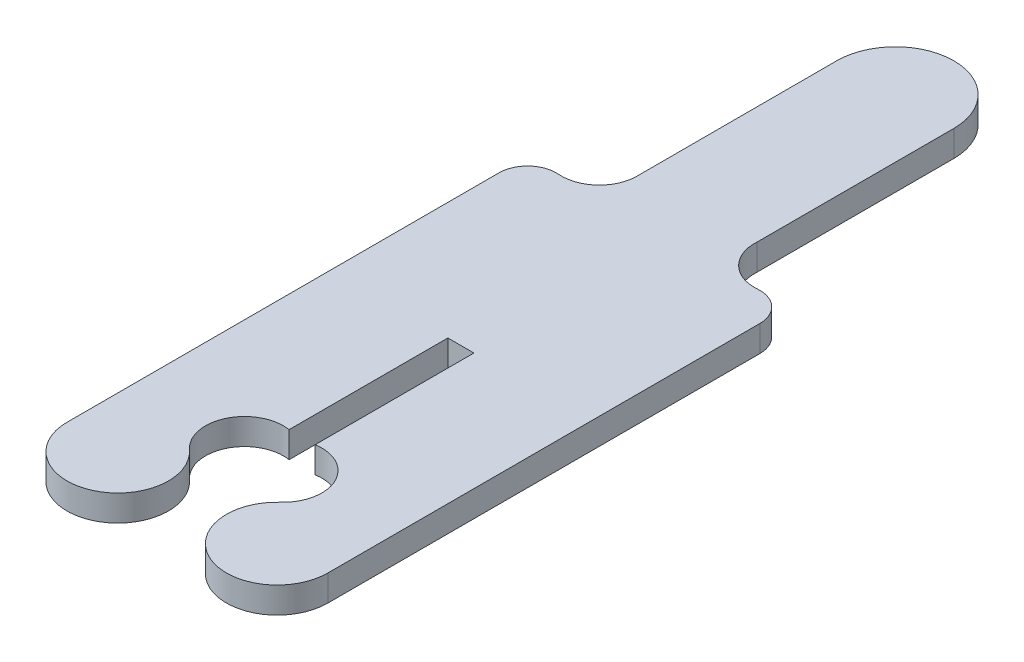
ISO-10303-21;
HEADER;
FILE_DESCRIPTION(('STEP AP214'),'2;1');
FILE_NAME('part.step','',(''),(''),'','','');
FILE_SCHEMA(('AUTOMOTIVE_DESIGN { 1 0 10303 214 1 1 1 1 }'));
ENDSEC;
DATA;
#1=APPLICATION_CONTEXT('core data for automotive mechanical design processes');
#2=APPLICATION_PROTOCOL_DEFINITION('international standard','automotive_design',2000,#1);
#3=PRODUCT_CONTEXT('',#1,'mechanical');
#4=PRODUCT('Part','Part','',(#3));
#5=PRODUCT_RELATED_PRODUCT_CATEGORY('part','',(#4));
#6=PRODUCT_DEFINITION_FORMATION('','',#4);
#7=PRODUCT_DEFINITION_CONTEXT('part definition',#1,'design');
#8=PRODUCT_DEFINITION('design','',#6,#7);
#9=PRODUCT_DEFINITION_SHAPE('','',#8);
#10=(LENGTH_UNIT() NAMED_UNIT(*) SI_UNIT(.MILLI.,.METRE.));
#11=(NAMED_UNIT(*) PLANE_ANGLE_UNIT() SI_UNIT($,.RADIAN.));
#12=(NAMED_UNIT(*) SI_UNIT($,.STERADIAN.) SOLID_ANGLE_UNIT());
#13=UNCERTAINTY_MEASURE_WITH_UNIT(LENGTH_MEASURE(1.E-05),#10,'distance_accuracy_value','');
#14=(GEOMETRIC_REPRESENTATION_CONTEXT(3) GLOBAL_UNCERTAINTY_ASSIGNED_CONTEXT((#13)) GLOBAL_UNIT_ASSIGNED_CONTEXT((#10,
#11,#12)) REPRESENTATION_CONTEXT('',''));
#15=CARTESIAN_POINT('',(0.,0.,0.));
#16=DIRECTION('',(0.,0.,1.));
#17=DIRECTION('',(1.,0.,0.));
#18=AXIS2_PLACEMENT_3D('',#15,#16,#17);
#19=CARTESIAN_POINT('',(-41777.0225889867,3.,-18289.7814477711));
#20=DIRECTION('',(0.,-1.,0.));
#21=DIRECTION('',(0.,0.,-1.));
#22=AXIS2_PLACEMENT_3D('',#19,#20,#21);
#23=CYLINDRICAL_SURFACE('',#22,4.47729575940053);
#24=CARTESIAN_POINT('',(-41777.0225889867,0.,-18289.7814477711));
#25=DIRECTION('',(0.,-1.,0.));
#26=DIRECTION('',(0.,0.,1.));
#27=AXIS2_PLACEMENT_3D('',#24,#25,#26);
#28=CIRCLE('',#27,4.47729575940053);
#29=CARTESIAN_POINT('',(-41777.738281,0.,-18294.201172));
#30=VERTEX_POINT('',#29);
#31=CARTESIAN_POINT('',(-41774.003968,0.,-18286.474772));
#32=VERTEX_POINT('',#31);
#33=EDGE_CURVE('E180',#30,#32,#28,.T.);
#34=ORIENTED_EDGE('',*,*,#33,.T.);
#35=DIRECTION('',(0.,-1.,0.));
#36=VECTOR('',#35,1.);
#37=CARTESIAN_POINT('',(-41774.003968,3.,-18286.474772));
#38=LINE('',#37,#36);
#39=CARTESIAN_POINT('',(-41774.003968,3.,-18286.474772));
#40=VERTEX_POINT('',#39);
#41=EDGE_CURVE('E11',#40,#32,#38,.T.);
#42=ORIENTED_EDGE('',*,*,#41,.F.);
#43=CARTESIAN_POINT('',(-41777.0225889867,3.,-18289.7814477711));
#44=DIRECTION('',(0.,-1.,0.));
#45=DIRECTION('',(0.,0.,1.));
#46=AXIS2_PLACEMENT_3D('',#43,#44,#45);
#47=CIRCLE('',#46,4.47729575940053);
#48=CARTESIAN_POINT('',(-41777.738281,3.,-18294.201172));
#49=VERTEX_POINT('',#48);
#50=EDGE_CURVE('E210',#49,#40,#47,.T.);
#51=ORIENTED_EDGE('',*,*,#50,.F.);
#52=DIRECTION('',(0.,-1.,0.));
#53=VECTOR('',#52,1.);
#54=CARTESIAN_POINT('',(-41777.738281,3.,-18294.201172));
#55=LINE('',#54,#53);
#56=EDGE_CURVE('E176',#49,#30,#55,.T.);
#57=ORIENTED_EDGE('',*,*,#56,.T.);
#58=EDGE_LOOP('',(#34,#42,#51,#57));
#59=FACE_BOUND('',#58,.T.);
#60=ADVANCED_FACE('F36',(#59),#23,.F.);
#61=CARTESIAN_POINT('',(-41770.0709351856,3.,-18282.1623839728));
#62=DIRECTION('',(0.,-1.,0.));
#63=DIRECTION('',(0.,0.,-1.));
#64=AXIS2_PLACEMENT_3D('',#61,#62,#63);
#65=CYLINDRICAL_SURFACE('',#64,5.83656042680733);
#66=CARTESIAN_POINT('',(-41770.0709351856,0.,-18282.1623839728));
#67=DIRECTION('',(0.,1.,0.));
#68=DIRECTION('',(0.,0.,1.));
#69=AXIS2_PLACEMENT_3D('',#66,#67,#68);
#70=CIRCLE('',#69,5.83656042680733);
#71=CARTESIAN_POINT('',(-41764.234375,0.,-18282.164062));
#72=VERTEX_POINT('',#71);
#73=EDGE_CURVE('E183',#32,#72,#70,.T.);
#74=ORIENTED_EDGE('',*,*,#73,.T.);
#75=DIRECTION('',(0.,-1.,0.));
#76=VECTOR('',#75,1.);
#77=CARTESIAN_POINT('',(-41764.234375,3.,-18282.164062));
#78=LINE('',#77,#76);
#79=CARTESIAN_POINT('',(-41764.234375,3.,-18282.164062));
#80=VERTEX_POINT('',#79);
#81=EDGE_CURVE('E44',#80,#72,#78,.T.);
#82=ORIENTED_EDGE('',*,*,#81,.F.);
#83=CARTESIAN_POINT('',(-41770.0709351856,3.,-18282.1623839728));
#84=DIRECTION('',(0.,1.,0.));
#85=DIRECTION('',(0.,0.,1.));
#86=AXIS2_PLACEMENT_3D('',#83,#84,#85);
#87=CIRCLE('',#86,5.83656042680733);
#88=EDGE_CURVE('E119',#40,#80,#87,.T.);
#89=ORIENTED_EDGE('',*,*,#88,.F.);
#90=ORIENTED_EDGE('',*,*,#41,.T.);
#91=EDGE_LOOP('',(#74,#82,#89,#90));
#92=FACE_BOUND('',#91,.T.);
#93=ADVANCED_FACE('F308',(#92),#65,.T.);
#94=CARTESIAN_POINT('',(-41764.2415839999,3.,-18331.840166));
#95=DIRECTION('',(-0.999999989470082,0.,0.000145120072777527));
#96=DIRECTION('',(0.000145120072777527,0.,0.999999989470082));
#97=AXIS2_PLACEMENT_3D('',#94,#95,#96);
#98=PLANE('',#97);
#99=DIRECTION('',(-0.000145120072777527,0.,-0.999999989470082));
#100=VECTOR('',#99,1.);
#101=CARTESIAN_POINT('',(-41764.2415839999,0.,-18331.840166));
#102=LINE('',#101,#100);
#103=CARTESIAN_POINT('',(-41764.2415839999,0.,-18331.840166));
#104=VERTEX_POINT('',#103);
#105=EDGE_CURVE('E185',#72,#104,#102,.T.);
#106=ORIENTED_EDGE('',*,*,#105,.T.);
#107=DIRECTION('',(0.,-1.,0.));
#108=VECTOR('',#107,1.);
#109=CARTESIAN_POINT('',(-41764.2415839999,3.,-18331.840166));
#110=LINE('',#109,#108);
#111=CARTESIAN_POINT('',(-41764.2415839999,3.,-18331.840166));
#112=VERTEX_POINT('',#111);
#113=EDGE_CURVE('E241',#112,#104,#110,.T.);
#114=ORIENTED_EDGE('',*,*,#113,.F.);
#115=DIRECTION('',(-0.000145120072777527,0.,-0.999999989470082));
#116=VECTOR('',#115,1.);
#117=CARTESIAN_POINT('',(-41764.2415839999,3.,-18331.840166));
#118=LINE('',#117,#116);
#119=EDGE_CURVE('E249',#80,#112,#118,.T.);
#120=ORIENTED_EDGE('',*,*,#119,.F.);
#121=ORIENTED_EDGE('',*,*,#81,.T.);
#122=EDGE_LOOP('',(#106,#114,#120,#121));
#123=FACE_BOUND('',#122,.T.);
#124=ADVANCED_FACE('F247',(#123),#98,.F.);
#125=CARTESIAN_POINT('',(-41767.5394138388,3.,-18331.8401681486));
#126=DIRECTION('',(0.,-1.,0.));
#127=DIRECTION('',(0.,0.,-1.));
#128=AXIS2_PLACEMENT_3D('',#125,#126,#127);
#129=CYLINDRICAL_SURFACE('',#128,3.29782983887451);
#130=CARTESIAN_POINT('',(-41767.5394138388,0.,-18331.8401681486));
#131=DIRECTION('',(0.,1.,0.));
#132=DIRECTION('',(0.,0.,1.));
#133=AXIS2_PLACEMENT_3D('',#130,#131,#132);
#134=CIRCLE('',#133,3.29782983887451);
#135=CARTESIAN_POINT('',(-41767.8091419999,0.,-18335.126949));
#136=VERTEX_POINT('',#135);
#137=EDGE_CURVE('E187',#104,#136,#134,.T.);
#138=ORIENTED_EDGE('',*,*,#137,.T.);
#139=DIRECTION('',(0.,-1.,0.));
#140=VECTOR('',#139,1.);
#141=CARTESIAN_POINT('',(-41767.8091419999,3.,-18335.126949));
#142=LINE('',#141,#140);
#143=CARTESIAN_POINT('',(-41767.8091419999,3.,-18335.126949));
#144=VERTEX_POINT('',#143);
#145=EDGE_CURVE('E238',#144,#136,#142,.T.);
#146=ORIENTED_EDGE('',*,*,#145,.F.);
#147=CARTESIAN_POINT('',(-41767.5394138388,3.,-18331.8401681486));
#148=DIRECTION('',(0.,1.,0.));
#149=DIRECTION('',(0.,0.,1.));
#150=AXIS2_PLACEMENT_3D('',#147,#148,#149);
#151=CIRCLE('',#150,3.29782983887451);
#152=EDGE_CURVE('E267',#112,#144,#151,.T.);
#153=ORIENTED_EDGE('',*,*,#152,.F.);
#154=ORIENTED_EDGE('',*,*,#113,.T.);
#155=EDGE_LOOP('',(#138,#146,#153,#154));
#156=FACE_BOUND('',#155,.T.);
#157=ADVANCED_FACE('F258',(#156),#129,.T.);
#158=CARTESIAN_POINT('',(-41768.156767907,3.,-18339.477072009));
#159=DIRECTION('',(0.,-1.,0.));
#160=DIRECTION('',(0.,0.,-1.));
#161=AXIS2_PLACEMENT_3D('',#158,#159,#160);
#162=CYLINDRICAL_SURFACE('',#161,4.36399060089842);
#163=CARTESIAN_POINT('',(-41768.156767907,0.,-18339.477072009));
#164=DIRECTION('',(0.,-1.,0.));
#165=DIRECTION('',(0.,0.,1.));
#166=AXIS2_PLACEMENT_3D('',#163,#164,#165);
#167=CIRCLE('',#166,4.36399060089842);
#168=CARTESIAN_POINT('',(-41772.511719,0.,-18339.757812));
#169=VERTEX_POINT('',#168);
#170=EDGE_CURVE('E189',#136,#169,#167,.T.);
#171=ORIENTED_EDGE('',*,*,#170,.T.);
#172=DIRECTION('',(0.,-1.,0.));
#173=VECTOR('',#172,1.);
#174=CARTESIAN_POINT('',(-41772.511719,3.,-18339.757812));
#175=LINE('',#174,#173);
#176=CARTESIAN_POINT('',(-41772.511719,3.,-18339.757812));
#177=VERTEX_POINT('',#176);
#178=EDGE_CURVE('E235',#177,#169,#175,.T.);
#179=ORIENTED_EDGE('',*,*,#178,.F.);
#180=CARTESIAN_POINT('',(-41768.156767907,3.,-18339.477072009));
#181=DIRECTION('',(0.,-1.,0.));
#182=DIRECTION('',(0.,0.,1.));
#183=AXIS2_PLACEMENT_3D('',#180,#181,#182);
#184=CIRCLE('',#183,4.36399060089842);
#185=EDGE_CURVE('E264',#144,#177,#184,.T.);
#186=ORIENTED_EDGE('',*,*,#185,.F.);
#187=ORIENTED_EDGE('',*,*,#145,.T.);
#188=EDGE_LOOP('',(#171,#179,#186,#187));
#189=FACE_BOUND('',#188,.T.);
#190=ADVANCED_FACE('F262',(#189),#162,.F.);
#191=CARTESIAN_POINT('',(-41772.5146589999,3.,-18362.419881));
#192=DIRECTION('',(-0.999999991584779,0.,0.000129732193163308));
#193=DIRECTION('',(0.000129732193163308,0.,0.999999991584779));
#194=AXIS2_PLACEMENT_3D('',#191,#192,#193);
#195=PLANE('',#194);
#196=DIRECTION('',(-0.000129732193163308,0.,-0.999999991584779));
#197=VECTOR('',#196,1.);
#198=CARTESIAN_POINT('',(-41772.5146589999,0.,-18362.419881));
#199=LINE('',#198,#197);
#200=CARTESIAN_POINT('',(-41772.5146589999,0.,-18362.419881));
#201=VERTEX_POINT('',#200);
#202=EDGE_CURVE('E191',#169,#201,#199,.T.);
#203=ORIENTED_EDGE('',*,*,#202,.T.);
#204=DIRECTION('',(0.,-1.,0.));
#205=VECTOR('',#204,1.);
#206=CARTESIAN_POINT('',(-41772.5146589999,3.,-18362.419881));
#207=LINE('',#206,#205);
#208=CARTESIAN_POINT('',(-41772.5146589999,3.,-18362.419881));
#209=VERTEX_POINT('',#208);
#210=EDGE_CURVE('E232',#209,#201,#207,.T.);
#211=ORIENTED_EDGE('',*,*,#210,.F.);
#212=DIRECTION('',(-0.000129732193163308,0.,-0.999999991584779));
#213=VECTOR('',#212,1.);
#214=CARTESIAN_POINT('',(-41772.5146589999,3.,-18362.419881));
#215=LINE('',#214,#213);
#216=EDGE_CURVE('E266',#177,#209,#215,.T.);
#217=ORIENTED_EDGE('',*,*,#216,.F.);
#218=ORIENTED_EDGE('',*,*,#178,.T.);
#219=EDGE_LOOP('',(#203,#211,#217,#218));
#220=FACE_BOUND('',#219,.T.);
#221=ADVANCED_FACE('F321',(#220),#195,.F.);
#222=CARTESIAN_POINT('',(-41779.2495169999,3.,-18362.4199237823));
#223=DIRECTION('',(0.,-1.,0.));
#224=DIRECTION('',(0.,0.,-1.));
#225=AXIS2_PLACEMENT_3D('',#222,#223,#224);
#226=CYLINDRICAL_SURFACE('',#225,6.73485800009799);
#227=CARTESIAN_POINT('',(-41779.2495169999,0.,-18362.4199237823));
#228=DIRECTION('',(0.,1.,0.));
#229=DIRECTION('',(0.,0.,1.));
#230=AXIS2_PLACEMENT_3D('',#227,#228,#229);
#231=CIRCLE('',#230,6.73485800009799);
#232=CARTESIAN_POINT('',(-41785.984375,0.,-18362.419922));
#233=VERTEX_POINT('',#232);
#234=EDGE_CURVE('E193',#201,#233,#231,.T.);
#235=ORIENTED_EDGE('',*,*,#234,.T.);
#236=DIRECTION('',(0.,-1.,0.));
#237=VECTOR('',#236,1.);
#238=CARTESIAN_POINT('',(-41785.984375,3.,-18362.419922));
#239=LINE('',#238,#237);
#240=CARTESIAN_POINT('',(-41785.984375,3.,-18362.419922));
#241=VERTEX_POINT('',#240);
#242=EDGE_CURVE('E229',#241,#233,#239,.T.);
#243=ORIENTED_EDGE('',*,*,#242,.F.);
#244=CARTESIAN_POINT('',(-41779.2495169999,3.,-18362.4199237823));
#245=DIRECTION('',(0.,1.,0.));
#246=DIRECTION('',(0.,0.,1.));
#247=AXIS2_PLACEMENT_3D('',#244,#245,#246);
#248=CIRCLE('',#247,6.73485800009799);
#249=EDGE_CURVE('E269',#209,#241,#248,.T.);
#250=ORIENTED_EDGE('',*,*,#249,.F.);
#251=ORIENTED_EDGE('',*,*,#210,.T.);
#252=EDGE_LOOP('',(#235,#243,#250,#251));
#253=FACE_BOUND('',#252,.T.);
#254=ADVANCED_FACE('F324',(#253),#226,.T.);
#255=CARTESIAN_POINT('',(-41785.977895,3.,-18339.757464));
#256=DIRECTION('',(0.999999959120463,0.,-0.000285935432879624));
#257=DIRECTION('',(-0.000285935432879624,0.,-0.999999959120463));
#258=AXIS2_PLACEMENT_3D('',#255,#256,#257);
#259=PLANE('',#258);
#260=DIRECTION('',(0.000285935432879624,0.,0.999999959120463));
#261=VECTOR('',#260,1.);
#262=CARTESIAN_POINT('',(-41785.977895,0.,-18339.757464));
#263=LINE('',#262,#261);
#264=CARTESIAN_POINT('',(-41785.977895,0.,-18339.757464));
#265=VERTEX_POINT('',#264);
#266=EDGE_CURVE('E195',#233,#265,#263,.T.);
#267=ORIENTED_EDGE('',*,*,#266,.T.);
#268=DIRECTION('',(0.,-1.,0.));
#269=VECTOR('',#268,1.);
#270=CARTESIAN_POINT('',(-41785.977895,3.,-18339.757464));
#271=LINE('',#270,#269);
#272=CARTESIAN_POINT('',(-41785.977895,3.,-18339.757464));
#273=VERTEX_POINT('',#272);
#274=EDGE_CURVE('E226',#273,#265,#271,.T.);
#275=ORIENTED_EDGE('',*,*,#274,.F.);
#276=DIRECTION('',(0.000285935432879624,0.,0.999999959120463));
#277=VECTOR('',#276,1.);
#278=CARTESIAN_POINT('',(-41785.977895,3.,-18339.757464));
#279=LINE('',#278,#277);
#280=EDGE_CURVE('E275',#241,#273,#279,.T.);
#281=ORIENTED_EDGE('',*,*,#280,.F.);
#282=ORIENTED_EDGE('',*,*,#242,.T.);
#283=EDGE_LOOP('',(#267,#275,#281,#282));
#284=FACE_BOUND('',#283,.T.);
#285=ADVANCED_FACE('F328',(#284),#259,.F.);
#286=CARTESIAN_POINT('',(-41790.332211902,3.,-18339.4724777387));
#287=DIRECTION('',(0.,-1.,0.));
#288=DIRECTION('',(0.,0.,-1.));
#289=AXIS2_PLACEMENT_3D('',#286,#287,#288);
#290=CYLINDRICAL_SURFACE('',#289,4.36363298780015);
#291=CARTESIAN_POINT('',(-41790.332211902,0.,-18339.4724777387));
#292=DIRECTION('',(0.,-1.,0.));
#293=DIRECTION('',(0.,0.,1.));
#294=AXIS2_PLACEMENT_3D('',#291,#292,#293);
#295=CIRCLE('',#294,4.36363298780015);
#296=CARTESIAN_POINT('',(-41790.681193,0.,-18335.122822));
#297=VERTEX_POINT('',#296);
#298=EDGE_CURVE('E197',#265,#297,#295,.T.);
#299=ORIENTED_EDGE('',*,*,#298,.T.);
#300=DIRECTION('',(0.,-1.,0.));
#301=VECTOR('',#300,1.);
#302=CARTESIAN_POINT('',(-41790.681193,3.,-18335.122822));
#303=LINE('',#302,#301);
#304=CARTESIAN_POINT('',(-41790.681193,3.,-18335.122822));
#305=VERTEX_POINT('',#304);
#306=EDGE_CURVE('E223',#305,#297,#303,.T.);
#307=ORIENTED_EDGE('',*,*,#306,.F.);
#308=CARTESIAN_POINT('',(-41790.332211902,3.,-18339.4724777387));
#309=DIRECTION('',(0.,-1.,0.));
#310=DIRECTION('',(0.,0.,1.));
#311=AXIS2_PLACEMENT_3D('',#308,#309,#310);
#312=CIRCLE('',#311,4.36363298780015);
#313=EDGE_CURVE('E277',#273,#305,#312,.T.);
#314=ORIENTED_EDGE('',*,*,#313,.F.);
#315=ORIENTED_EDGE('',*,*,#274,.T.);
#316=EDGE_LOOP('',(#299,#307,#314,#315));
#317=FACE_BOUND('',#316,.T.);
#318=ADVANCED_FACE('F332',(#317),#290,.F.);
#319=CARTESIAN_POINT('',(-41790.9450097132,3.,-18331.8362160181));
#320=DIRECTION('',(0.,-1.,0.));
#321=DIRECTION('',(0.,0.,-1.));
#322=AXIS2_PLACEMENT_3D('',#319,#320,#321);
#323=CYLINDRICAL_SURFACE('',#322,3.29717729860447);
#324=CARTESIAN_POINT('',(-41790.9450097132,0.,-18331.8362160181));
#325=DIRECTION('',(0.,1.,0.));
#326=DIRECTION('',(0.,0.,1.));
#327=AXIS2_PLACEMENT_3D('',#324,#325,#326);
#328=CIRCLE('',#327,3.29717729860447);
#329=CARTESIAN_POINT('',(-41794.242187,0.,-18331.835937));
#330=VERTEX_POINT('',#329);
#331=EDGE_CURVE('E199',#297,#330,#328,.T.);
#332=ORIENTED_EDGE('',*,*,#331,.T.);
#333=DIRECTION('',(0.,-1.,0.));
#334=VECTOR('',#333,1.);
#335=CARTESIAN_POINT('',(-41794.242187,3.,-18331.835937));
#336=LINE('',#335,#334);
#337=CARTESIAN_POINT('',(-41794.242187,3.,-18331.835937));
#338=VERTEX_POINT('',#337);
#339=EDGE_CURVE('E220',#338,#330,#336,.T.);
#340=ORIENTED_EDGE('',*,*,#339,.F.);
#341=CARTESIAN_POINT('',(-41790.9450097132,3.,-18331.8362160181));
#342=DIRECTION('',(0.,1.,0.));
#343=DIRECTION('',(0.,0.,1.));
#344=AXIS2_PLACEMENT_3D('',#341,#342,#343);
#345=CIRCLE('',#344,3.29717729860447);
#346=EDGE_CURVE('E279',#305,#338,#345,.T.);
#347=ORIENTED_EDGE('',*,*,#346,.F.);
#348=ORIENTED_EDGE('',*,*,#306,.T.);
#349=EDGE_LOOP('',(#332,#340,#347,#348));
#350=FACE_BOUND('',#349,.T.);
#351=ADVANCED_FACE('F336',(#350),#323,.T.);
#352=CARTESIAN_POINT('',(-41794.239526,3.,-18282.160613));
#353=DIRECTION('',(0.999999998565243,0.,-5.35678441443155E-05));
#354=DIRECTION('',(-5.35678441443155E-05,0.,-0.999999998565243));
#355=AXIS2_PLACEMENT_3D('',#352,#353,#354);
#356=PLANE('',#355);
#357=DIRECTION('',(5.35678441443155E-05,0.,0.999999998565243));
#358=VECTOR('',#357,1.);
#359=CARTESIAN_POINT('',(-41794.239526,0.,-18282.160613));
#360=LINE('',#359,#358);
#361=CARTESIAN_POINT('',(-41794.239526,0.,-18282.160613));
#362=VERTEX_POINT('',#361);
#363=EDGE_CURVE('E201',#330,#362,#360,.T.);
#364=ORIENTED_EDGE('',*,*,#363,.T.);
#365=DIRECTION('',(0.,-1.,0.));
#366=VECTOR('',#365,1.);
#367=CARTESIAN_POINT('',(-41794.239526,3.,-18282.160613));
#368=LINE('',#367,#366);
#369=CARTESIAN_POINT('',(-41794.239526,3.,-18282.160613));
#370=VERTEX_POINT('',#369);
#371=EDGE_CURVE('E217',#370,#362,#368,.T.);
#372=ORIENTED_EDGE('',*,*,#371,.F.);
#373=DIRECTION('',(5.35678441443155E-05,0.,0.999999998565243));
#374=VECTOR('',#373,1.);
#375=CARTESIAN_POINT('',(-41794.239526,3.,-18282.160613));
#376=LINE('',#375,#374);
#377=EDGE_CURVE('E281',#338,#370,#376,.T.);
#378=ORIENTED_EDGE('',*,*,#377,.F.);
#379=ORIENTED_EDGE('',*,*,#339,.T.);
#380=EDGE_LOOP('',(#364,#372,#378,#379));
#381=FACE_BOUND('',#380,.T.);
#382=ADVANCED_FACE('F340',(#381),#356,.F.);
#383=CARTESIAN_POINT('',(-41788.4018201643,3.,-18282.1623402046));
#384=DIRECTION('',(0.,-1.,0.));
#385=DIRECTION('',(0.,0.,-1.));
#386=AXIS2_PLACEMENT_3D('',#383,#384,#385);
#387=CYLINDRICAL_SURFACE('',#386,5.8377060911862);
#388=CARTESIAN_POINT('',(-41788.4018201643,0.,-18282.1623402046));
#389=DIRECTION('',(0.,1.,0.));
#390=DIRECTION('',(0.,0.,1.));
#391=AXIS2_PLACEMENT_3D('',#388,#389,#390);
#392=CIRCLE('',#391,5.8377060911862);
#393=CARTESIAN_POINT('',(-41784.466445,0.,-18286.474142));
#394=VERTEX_POINT('',#393);
#395=EDGE_CURVE('E203',#362,#394,#392,.T.);
#396=ORIENTED_EDGE('',*,*,#395,.T.);
#397=DIRECTION('',(0.,-1.,0.));
#398=VECTOR('',#397,1.);
#399=CARTESIAN_POINT('',(-41784.466445,3.,-18286.474142));
#400=LINE('',#399,#398);
#401=CARTESIAN_POINT('',(-41784.466445,3.,-18286.474142));
#402=VERTEX_POINT('',#401);
#403=EDGE_CURVE('E214',#402,#394,#400,.T.);
#404=ORIENTED_EDGE('',*,*,#403,.F.);
#405=CARTESIAN_POINT('',(-41788.4018201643,3.,-18282.1623402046));
#406=DIRECTION('',(0.,1.,0.));
#407=DIRECTION('',(0.,0.,1.));
#408=AXIS2_PLACEMENT_3D('',#405,#406,#407);
#409=CIRCLE('',#408,5.8377060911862);
#410=EDGE_CURVE('E283',#370,#402,#409,.T.);
#411=ORIENTED_EDGE('',*,*,#410,.F.);
#412=ORIENTED_EDGE('',*,*,#371,.T.);
#413=EDGE_LOOP('',(#396,#404,#411,#412));
#414=FACE_BOUND('',#413,.T.);
#415=ADVANCED_FACE('F289',(#414),#387,.T.);
#416=CARTESIAN_POINT('',(-41781.4495327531,3.,-18289.782552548));
#417=DIRECTION('',(0.,-1.,0.));
#418=DIRECTION('',(0.,0.,-1.));
#419=AXIS2_PLACEMENT_3D('',#416,#417,#418);
#420=CYLINDRICAL_SURFACE('',#419,4.47742558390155);
#421=CARTESIAN_POINT('',(-41781.4495327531,0.,-18289.782552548));
#422=DIRECTION('',(0.,-1.,0.));
#423=DIRECTION('',(0.,0.,1.));
#424=AXIS2_PLACEMENT_3D('',#421,#422,#423);
#425=CIRCLE('',#424,4.47742558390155);
#426=CARTESIAN_POINT('',(-41780.738281,0.,-18294.203125));
#427=VERTEX_POINT('',#426);
#428=EDGE_CURVE('E205',#394,#427,#425,.T.);
#429=ORIENTED_EDGE('',*,*,#428,.T.);
#430=DIRECTION('',(0.,-1.,0.));
#431=VECTOR('',#430,1.);
#432=CARTESIAN_POINT('',(-41780.738281,3.,-18294.203125));
#433=LINE('',#432,#431);
#434=CARTESIAN_POINT('',(-41780.738281,3.,-18294.203125));
#435=VERTEX_POINT('',#434);
#436=EDGE_CURVE('E171',#435,#427,#433,.T.);
#437=ORIENTED_EDGE('',*,*,#436,.F.);
#438=CARTESIAN_POINT('',(-41781.4495327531,3.,-18289.782552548));
#439=DIRECTION('',(0.,-1.,0.));
#440=DIRECTION('',(0.,0.,1.));
#441=AXIS2_PLACEMENT_3D('',#438,#439,#440);
#442=CIRCLE('',#441,4.47742558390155);
#443=EDGE_CURVE('E162',#402,#435,#442,.T.);
#444=ORIENTED_EDGE('',*,*,#443,.F.);
#445=ORIENTED_EDGE('',*,*,#403,.T.);
#446=EDGE_LOOP('',(#429,#437,#444,#445));
#447=FACE_BOUND('',#446,.T.);
#448=ADVANCED_FACE('F293',(#447),#420,.F.);
#449=CARTESIAN_POINT('',(-41780.738281,3.,-18312.457031));
#450=DIRECTION('',(-1.,0.,0.));
#451=DIRECTION('',(0.,0.,1.));
#452=AXIS2_PLACEMENT_3D('',#449,#450,#451);
#453=PLANE('',#452);
#454=DIRECTION('',(0.,0.,-1.));
#455=VECTOR('',#454,1.);
#456=CARTESIAN_POINT('',(-41780.738281,0.,-18312.457031));
#457=LINE('',#456,#455);
#458=CARTESIAN_POINT('',(-41780.738281,0.,-18312.457031));
#459=VERTEX_POINT('',#458);
#460=EDGE_CURVE('E170',#427,#459,#457,.T.);
#461=ORIENTED_EDGE('',*,*,#460,.T.);
#462=DIRECTION('',(0.,-1.,0.));
#463=VECTOR('',#462,1.);
#464=CARTESIAN_POINT('',(-41780.738281,3.,-18312.457031));
#465=LINE('',#464,#463);
#466=CARTESIAN_POINT('',(-41780.738281,3.,-18312.457031));
#467=VERTEX_POINT('',#466);
#468=EDGE_CURVE('E167',#467,#459,#465,.T.);
#469=ORIENTED_EDGE('',*,*,#468,.F.);
#470=DIRECTION('',(0.,0.,-1.));
#471=VECTOR('',#470,1.);
#472=CARTESIAN_POINT('',(-41780.738281,3.,-18312.457031));
#473=LINE('',#472,#471);
#474=EDGE_CURVE('E156',#435,#467,#473,.T.);
#475=ORIENTED_EDGE('',*,*,#474,.F.);
#476=ORIENTED_EDGE('',*,*,#436,.T.);
#477=EDGE_LOOP('',(#461,#469,#475,#476));
#478=FACE_BOUND('',#477,.T.);
#479=ADVANCED_FACE('F168',(#478),#453,.F.);
#480=CARTESIAN_POINT('',(-41777.742187,3.,-18312.455078));
#481=DIRECTION('',(0.000651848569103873,0.,-0.999999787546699));
#482=DIRECTION('',(-0.999999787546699,0.,-0.000651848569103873));
#483=AXIS2_PLACEMENT_3D('',#480,#481,#482);
#484=PLANE('',#483);
#485=DIRECTION('',(0.999999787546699,0.,0.000651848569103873));
#486=VECTOR('',#485,1.);
#487=CARTESIAN_POINT('',(-41777.742187,0.,-18312.455078));
#488=LINE('',#487,#486);
#489=CARTESIAN_POINT('',(-41777.742187,0.,-18312.455078));
#490=VERTEX_POINT('',#489);
#491=EDGE_CURVE('E105',#459,#490,#488,.T.);
#492=ORIENTED_EDGE('',*,*,#491,.T.);
#493=DIRECTION('',(0.,-1.,0.));
#494=VECTOR('',#493,1.);
#495=CARTESIAN_POINT('',(-41777.742187,3.,-18312.455078));
#496=LINE('',#495,#494);
#497=CARTESIAN_POINT('',(-41777.742187,3.,-18312.455078));
#498=VERTEX_POINT('',#497);
#499=EDGE_CURVE('E172',#498,#490,#496,.T.);
#500=ORIENTED_EDGE('',*,*,#499,.F.);
#501=DIRECTION('',(0.999999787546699,0.,0.000651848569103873));
#502=VECTOR('',#501,1.);
#503=CARTESIAN_POINT('',(-41777.742187,3.,-18312.455078));
#504=LINE('',#503,#502);
#505=EDGE_CURVE('E160',#467,#498,#504,.T.);
#506=ORIENTED_EDGE('',*,*,#505,.F.);
#507=ORIENTED_EDGE('',*,*,#468,.T.);
#508=EDGE_LOOP('',(#492,#500,#506,#507));
#509=FACE_BOUND('',#508,.T.);
#510=ADVANCED_FACE('F174',(#509),#484,.F.);
#511=CARTESIAN_POINT('',(-41777.738281,3.,-18294.201172));
#512=DIRECTION('',(0.999999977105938,0.,-0.000213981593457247));
#513=DIRECTION('',(-0.000213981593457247,0.,-0.999999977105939));
#514=AXIS2_PLACEMENT_3D('',#511,#512,#513);
#515=PLANE('',#514);
#516=DIRECTION('',(0.000213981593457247,0.,0.999999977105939));
#517=VECTOR('',#516,1.);
#518=CARTESIAN_POINT('',(-41777.738281,0.,-18294.201172));
#519=LINE('',#518,#517);
#520=EDGE_CURVE('E111',#490,#30,#519,.T.);
#521=ORIENTED_EDGE('',*,*,#520,.T.);
#522=ORIENTED_EDGE('',*,*,#56,.F.);
#523=DIRECTION('',(0.000213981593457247,0.,0.999999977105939));
#524=VECTOR('',#523,1.);
#525=CARTESIAN_POINT('',(-41777.738281,3.,-18294.201172));
#526=LINE('',#525,#524);
#527=EDGE_CURVE('E52',#498,#49,#526,.T.);
#528=ORIENTED_EDGE('',*,*,#527,.F.);
#529=ORIENTED_EDGE('',*,*,#499,.T.);
#530=EDGE_LOOP('',(#521,#522,#528,#529));
#531=FACE_BOUND('',#530,.T.);
#532=ADVANCED_FACE('F297',(#531),#515,.F.);
#533=CARTESIAN_POINT('',(-41777.0225889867,3.,-18289.7814477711));
#534=DIRECTION('',(0.,1.,0.));
#535=DIRECTION('',(0.,0.,1.));
#536=AXIS2_PLACEMENT_3D('',#533,#534,#535);
#537=PLANE('',#536);
#538=ORIENTED_EDGE('',*,*,#50,.T.);
#539=ORIENTED_EDGE('',*,*,#88,.T.);
#540=ORIENTED_EDGE('',*,*,#119,.T.);
#541=ORIENTED_EDGE('',*,*,#152,.T.);
#542=ORIENTED_EDGE('',*,*,#185,.T.);
#543=ORIENTED_EDGE('',*,*,#216,.T.);
#544=ORIENTED_EDGE('',*,*,#249,.T.);
#545=ORIENTED_EDGE('',*,*,#280,.T.);
#546=ORIENTED_EDGE('',*,*,#313,.T.);
#547=ORIENTED_EDGE('',*,*,#346,.T.);
#548=ORIENTED_EDGE('',*,*,#377,.T.);
#549=ORIENTED_EDGE('',*,*,#410,.T.);
#550=ORIENTED_EDGE('',*,*,#443,.T.);
#551=ORIENTED_EDGE('',*,*,#474,.T.);
#552=ORIENTED_EDGE('',*,*,#505,.T.);
#553=ORIENTED_EDGE('',*,*,#527,.T.);
#554=EDGE_LOOP('',(#538,#539,#540,#541,#542,#543,#544,#545,#546,#547,#548,#549,#550,#551,#552,#553));
#555=FACE_BOUND('',#554,.T.);
#556=ADVANCED_FACE('F158',(#555),#537,.T.);
#557=CARTESIAN_POINT('',(-41777.0225889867,0.,-18289.7814477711));
#558=DIRECTION('',(0.,1.,0.));
#559=DIRECTION('',(0.,0.,1.));
#560=AXIS2_PLACEMENT_3D('',#557,#558,#559);
#561=PLANE('',#560);
#562=ORIENTED_EDGE('',*,*,#33,.F.);
#563=ORIENTED_EDGE('',*,*,#520,.F.);
#564=ORIENTED_EDGE('',*,*,#491,.F.);
#565=ORIENTED_EDGE('',*,*,#460,.F.);
#566=ORIENTED_EDGE('',*,*,#428,.F.);
#567=ORIENTED_EDGE('',*,*,#395,.F.);
#568=ORIENTED_EDGE('',*,*,#363,.F.);
#569=ORIENTED_EDGE('',*,*,#331,.F.);
#570=ORIENTED_EDGE('',*,*,#298,.F.);
#571=ORIENTED_EDGE('',*,*,#266,.F.);
#572=ORIENTED_EDGE('',*,*,#234,.F.);
#573=ORIENTED_EDGE('',*,*,#202,.F.);
#574=ORIENTED_EDGE('',*,*,#170,.F.);
#575=ORIENTED_EDGE('',*,*,#137,.F.);
#576=ORIENTED_EDGE('',*,*,#105,.F.);
#577=ORIENTED_EDGE('',*,*,#73,.F.);
#578=EDGE_LOOP('',(#562,#563,#564,#565,#566,#567,#568,#569,#570,#571,#572,#573,#574,#575,#576,#577));
#579=FACE_BOUND('',#578,.T.);
#580=ADVANCED_FACE('F253',(#579),#561,.F.);
#581=CLOSED_SHELL('',(#60,#93,#124,#157,#190,#221,#254,#285,#318,#351,#382,#415,#448,#479,#510,
#532,#556,#580));
#582=MANIFOLD_SOLID_BREP('B2',#581);
#583=ADVANCED_BREP_SHAPE_REPRESENTATION('',(#18,#582),#14);
#584=SHAPE_DEFINITION_REPRESENTATION(#9,#583);
ENDSEC;
END-ISO-10303-21;
